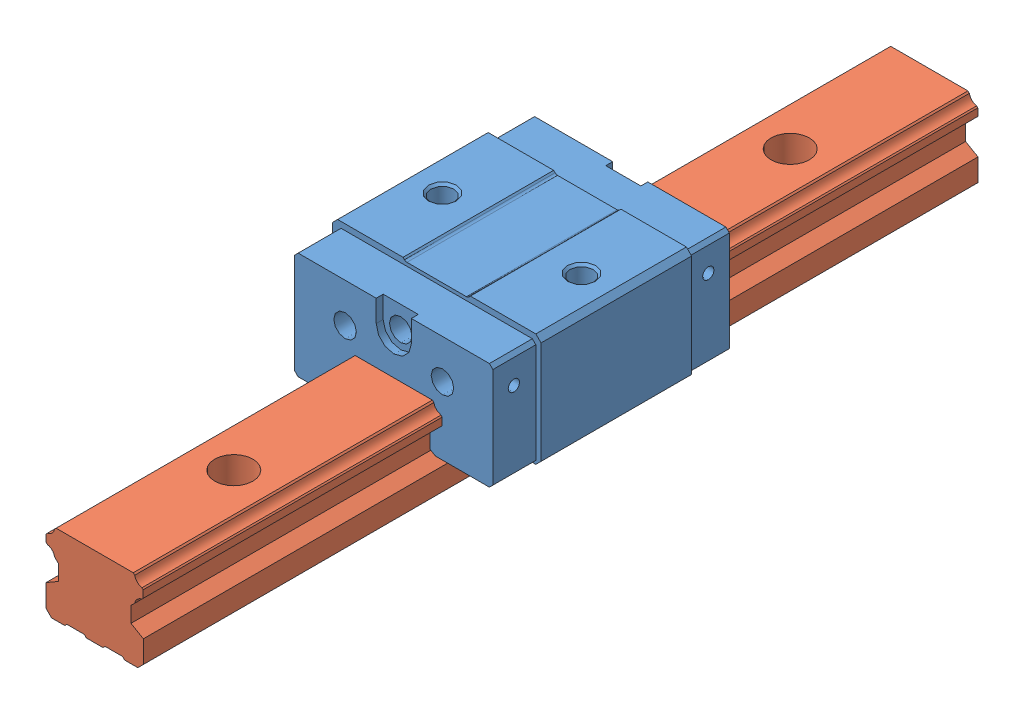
SolidWorks assembly ELH30SA1R240 E=40.sldasm, configuration Default (file format 13000). Lengths in mm.
Overall size (60 42.01 240).
2 component instances, 2 part files, 0 mates.
Components (placement in the parent):
- ELH30SA-1: ELH30SA.SLDPRT [Default] at (0 42 -86) size (60 32.5 68)
- ELR30R240 E=40-1: ELR30R240 E=40.SLDPRT [Default] at (0 42 0) size (28 23.01 240)
